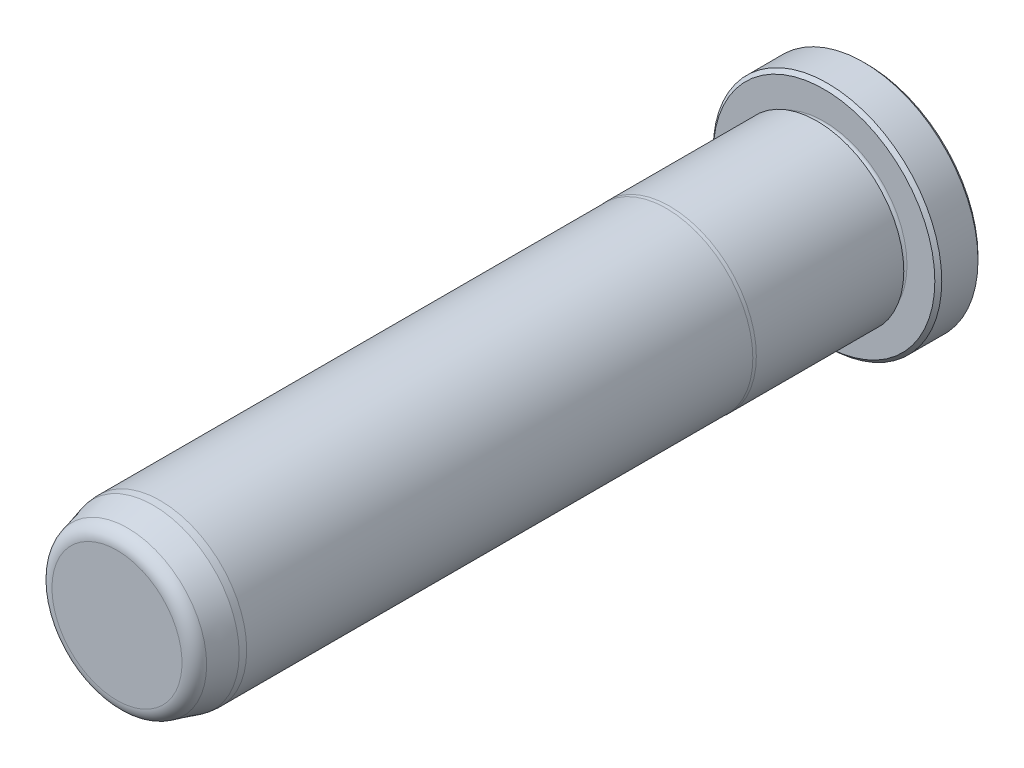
ISO-10303-21;
HEADER;
FILE_DESCRIPTION(('STEP AP214'),'2;1');
FILE_NAME('part.step','',(''),(''),'','','');
FILE_SCHEMA(('AUTOMOTIVE_DESIGN { 1 0 10303 214 1 1 1 1 }'));
ENDSEC;
DATA;
#1=APPLICATION_CONTEXT('core data for automotive mechanical design processes');
#2=APPLICATION_PROTOCOL_DEFINITION('international standard','automotive_design',2000,#1);
#3=PRODUCT_CONTEXT('',#1,'mechanical');
#4=PRODUCT('Part','Part','',(#3));
#5=PRODUCT_RELATED_PRODUCT_CATEGORY('part','',(#4));
#6=PRODUCT_DEFINITION_FORMATION('','',#4);
#7=PRODUCT_DEFINITION_CONTEXT('part definition',#1,'design');
#8=PRODUCT_DEFINITION('design','',#6,#7);
#9=PRODUCT_DEFINITION_SHAPE('','',#8);
#10=(LENGTH_UNIT() NAMED_UNIT(*) SI_UNIT(.MILLI.,.METRE.));
#11=(NAMED_UNIT(*) PLANE_ANGLE_UNIT() SI_UNIT($,.RADIAN.));
#12=(NAMED_UNIT(*) SI_UNIT($,.STERADIAN.) SOLID_ANGLE_UNIT());
#13=UNCERTAINTY_MEASURE_WITH_UNIT(LENGTH_MEASURE(1.E-05),#10,'distance_accuracy_value','');
#14=(GEOMETRIC_REPRESENTATION_CONTEXT(3) GLOBAL_UNCERTAINTY_ASSIGNED_CONTEXT((#13)) GLOBAL_UNIT_ASSIGNED_CONTEXT((#10,
#11,#12)) REPRESENTATION_CONTEXT('',''));
#15=CARTESIAN_POINT('',(0.,0.,0.));
#16=DIRECTION('',(0.,0.,1.));
#17=DIRECTION('',(1.,0.,0.));
#18=AXIS2_PLACEMENT_3D('',#15,#16,#17);
#19=CARTESIAN_POINT('',(0.,0.,0.));
#20=DIRECTION('',(0.,0.,1.));
#21=DIRECTION('',(1.,0.,0.));
#22=AXIS2_PLACEMENT_3D('',#19,#20,#21);
#23=PLANE('',#22);
#24=CARTESIAN_POINT('',(0.,0.,0.));
#25=DIRECTION('',(0.,0.,1.));
#26=DIRECTION('',(1.,0.,0.));
#27=AXIS2_PLACEMENT_3D('',#24,#25,#26);
#28=CIRCLE('',#27,12.192);
#29=CARTESIAN_POINT('',(12.192,0.,0.));
#30=VERTEX_POINT('',#29);
#31=EDGE_CURVE('E37',#30,#30,#28,.F.);
#32=ORIENTED_EDGE('',*,*,#31,.T.);
#33=EDGE_LOOP('',(#32));
#34=FACE_BOUND('',#33,.T.);
#35=ADVANCED_FACE('F30',(#34),#23,.F.);
#36=CARTESIAN_POINT('',(0.,0.,0.));
#37=DIRECTION('',(0.,0.,1.));
#38=DIRECTION('',(1.,0.,0.));
#39=AXIS2_PLACEMENT_3D('',#36,#37,#38);
#40=CYLINDRICAL_SURFACE('',#39,12.573);
#41=CARTESIAN_POINT('',(0.,0.,0.381000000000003));
#42=DIRECTION('',(0.,0.,1.));
#43=DIRECTION('',(1.,0.,0.));
#44=AXIS2_PLACEMENT_3D('',#41,#42,#43);
#45=CIRCLE('',#44,12.573);
#46=CARTESIAN_POINT('',(12.573,0.,0.381000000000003));
#47=VERTEX_POINT('',#46);
#48=EDGE_CURVE('E41',#47,#47,#45,.T.);
#49=ORIENTED_EDGE('',*,*,#48,.T.);
#50=EDGE_LOOP('',(#49));
#51=FACE_BOUND('',#50,.T.);
#52=CARTESIAN_POINT('',(0.,0.,4.36879999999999));
#53=DIRECTION('',(0.,0.,-1.));
#54=DIRECTION('',(-1.,0.,0.));
#55=AXIS2_PLACEMENT_3D('',#52,#53,#54);
#56=CIRCLE('',#55,12.573);
#57=CARTESIAN_POINT('',(-12.573,0.,4.36879999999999));
#58=VERTEX_POINT('',#57);
#59=EDGE_CURVE('E45',#58,#58,#56,.T.);
#60=ORIENTED_EDGE('',*,*,#59,.T.);
#61=EDGE_LOOP('',(#60));
#62=FACE_BOUND('',#61,.T.);
#63=ADVANCED_FACE('F118',(#51,#62),#40,.T.);
#64=CARTESIAN_POINT('',(0.,12.573,4.7498));
#65=DIRECTION('',(0.,0.,-1.));
#66=DIRECTION('',(-1.,0.,0.));
#67=AXIS2_PLACEMENT_3D('',#64,#65,#66);
#68=PLANE('',#67);
#69=CARTESIAN_POINT('',(0.,0.,4.7498));
#70=DIRECTION('',(0.,0.,-1.));
#71=DIRECTION('',(-1.,0.,0.));
#72=AXIS2_PLACEMENT_3D('',#69,#70,#71);
#73=CIRCLE('',#72,12.192);
#74=CARTESIAN_POINT('',(-12.192,0.,4.7498));
#75=VERTEX_POINT('',#74);
#76=EDGE_CURVE('E10',#75,#75,#73,.F.);
#77=ORIENTED_EDGE('',*,*,#76,.T.);
#78=EDGE_LOOP('',(#77));
#79=FACE_BOUND('',#78,.T.);
#80=CARTESIAN_POINT('',(0.,0.,4.7498));
#81=DIRECTION('',(0.,0.,1.));
#82=DIRECTION('',(1.,0.,0.));
#83=AXIS2_PLACEMENT_3D('',#80,#81,#82);
#84=CIRCLE('',#83,9.1313);
#85=CARTESIAN_POINT('',(9.1313,0.,4.7498));
#86=VERTEX_POINT('',#85);
#87=EDGE_CURVE('E56',#86,#86,#84,.T.);
#88=ORIENTED_EDGE('',*,*,#87,.F.);
#89=EDGE_LOOP('',(#88));
#90=FACE_BOUND('',#89,.T.);
#91=ADVANCED_FACE('F113',(#79,#90),#68,.F.);
#92=CARTESIAN_POINT('',(0.,0.,5.1308));
#93=DIRECTION('',(0.,0.,1.));
#94=DIRECTION('',(1.,0.,0.));
#95=AXIS2_PLACEMENT_3D('',#92,#93,#94);
#96=TOROIDAL_SURFACE('',#95,9.1313,0.381);
#97=CARTESIAN_POINT('',(0.,0.,5.5118));
#98=DIRECTION('',(0.,0.,1.));
#99=DIRECTION('',(1.,0.,0.));
#100=AXIS2_PLACEMENT_3D('',#97,#98,#99);
#101=CIRCLE('',#100,9.1313);
#102=CARTESIAN_POINT('',(9.1313,0.,5.5118));
#103=VERTEX_POINT('',#102);
#104=EDGE_CURVE('E59',#103,#103,#101,.T.);
#105=ORIENTED_EDGE('',*,*,#104,.F.);
#106=EDGE_LOOP('',(#105));
#107=FACE_BOUND('',#106,.T.);
#108=ORIENTED_EDGE('',*,*,#87,.T.);
#109=EDGE_LOOP('',(#108));
#110=FACE_BOUND('',#109,.T.);
#111=ADVANCED_FACE('F107',(#107,#110),#96,.F.);
#112=CARTESIAN_POINT('',(0.,9.1313,5.5118));
#113=DIRECTION('',(0.,0.,1.));
#114=DIRECTION('',(1.,0.,0.));
#115=AXIS2_PLACEMENT_3D('',#112,#113,#114);
#116=PLANE('',#115);
#117=CARTESIAN_POINT('',(0.,0.,5.5118));
#118=DIRECTION('',(0.,0.,1.));
#119=DIRECTION('',(1.,0.,0.));
#120=AXIS2_PLACEMENT_3D('',#117,#118,#119);
#121=CIRCLE('',#120,9.5377);
#122=CARTESIAN_POINT('',(9.5377,0.,5.5118));
#123=VERTEX_POINT('',#122);
#124=EDGE_CURVE('E62',#123,#123,#121,.T.);
#125=ORIENTED_EDGE('',*,*,#124,.F.);
#126=EDGE_LOOP('',(#125));
#127=FACE_BOUND('',#126,.T.);
#128=ORIENTED_EDGE('',*,*,#104,.T.);
#129=EDGE_LOOP('',(#128));
#130=FACE_BOUND('',#129,.T.);
#131=ADVANCED_FACE('F101',(#127,#130),#116,.F.);
#132=CARTESIAN_POINT('',(0.,0.,0.));
#133=DIRECTION('',(0.,0.,1.));
#134=DIRECTION('',(1.,0.,0.));
#135=AXIS2_PLACEMENT_3D('',#132,#133,#134);
#136=CYLINDRICAL_SURFACE('',#135,9.5377);
#137=CARTESIAN_POINT('',(0.,0.,21.7347630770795));
#138=DIRECTION('',(0.,0.,1.));
#139=DIRECTION('',(1.,0.,0.));
#140=AXIS2_PLACEMENT_3D('',#137,#138,#139);
#141=CIRCLE('',#140,9.5377);
#142=CARTESIAN_POINT('',(9.5377,0.,21.7347630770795));
#143=VERTEX_POINT('',#142);
#144=EDGE_CURVE('E65',#143,#143,#141,.T.);
#145=ORIENTED_EDGE('',*,*,#144,.F.);
#146=EDGE_LOOP('',(#145));
#147=FACE_BOUND('',#146,.T.);
#148=ORIENTED_EDGE('',*,*,#124,.T.);
#149=EDGE_LOOP('',(#148));
#150=FACE_BOUND('',#149,.T.);
#151=ADVANCED_FACE('F95',(#147,#150),#136,.T.);
#152=CARTESIAN_POINT('',(0.,0.,21.7347630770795));
#153=DIRECTION('',(0.,0.,-1.));
#154=DIRECTION('',(-1.,0.,0.));
#155=AXIS2_PLACEMENT_3D('',#152,#153,#154);
#156=CONICAL_SURFACE('',#155,9.5377,0.069813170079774);
#157=CARTESIAN_POINT('',(0.,0.,22.098));
#158=DIRECTION('',(0.,0.,1.));
#159=DIRECTION('',(1.,0.,0.));
#160=AXIS2_PLACEMENT_3D('',#157,#158,#159);
#161=CIRCLE('',#160,9.5123);
#162=CARTESIAN_POINT('',(9.5123,0.,22.098));
#163=VERTEX_POINT('',#162);
#164=EDGE_CURVE('E68',#163,#163,#161,.T.);
#165=ORIENTED_EDGE('',*,*,#164,.F.);
#166=EDGE_LOOP('',(#165));
#167=FACE_BOUND('',#166,.T.);
#168=ORIENTED_EDGE('',*,*,#144,.T.);
#169=EDGE_LOOP('',(#168));
#170=FACE_BOUND('',#169,.T.);
#171=ADVANCED_FACE('F89',(#167,#170),#156,.T.);
#172=CARTESIAN_POINT('',(0.,0.,0.));
#173=DIRECTION('',(0.,0.,1.));
#174=DIRECTION('',(1.,0.,0.));
#175=AXIS2_PLACEMENT_3D('',#172,#173,#174);
#176=CYLINDRICAL_SURFACE('',#175,9.5123);
#177=CARTESIAN_POINT('',(0.,0.,77.7875));
#178=DIRECTION('',(0.,0.,1.));
#179=DIRECTION('',(1.,0.,0.));
#180=AXIS2_PLACEMENT_3D('',#177,#178,#179);
#181=CIRCLE('',#180,9.51229999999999);
#182=CARTESIAN_POINT('',(9.51229999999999,0.,77.7875));
#183=VERTEX_POINT('',#182);
#184=EDGE_CURVE('E71',#183,#183,#181,.T.);
#185=ORIENTED_EDGE('',*,*,#184,.F.);
#186=EDGE_LOOP('',(#185));
#187=FACE_BOUND('',#186,.T.);
#188=ORIENTED_EDGE('',*,*,#164,.T.);
#189=EDGE_LOOP('',(#188));
#190=FACE_BOUND('',#189,.T.);
#191=ADVANCED_FACE('F83',(#187,#190),#176,.T.);
#192=CARTESIAN_POINT('',(0.,0.,77.7875));
#193=DIRECTION('',(0.,0.,-1.));
#194=DIRECTION('',(-1.,0.,0.));
#195=AXIS2_PLACEMENT_3D('',#192,#193,#194);
#196=CONICAL_SURFACE('',#195,9.51229999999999,0.0872664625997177);
#197=CARTESIAN_POINT('',(0.,0.,78.5495));
#198=DIRECTION('',(0.,0.,1.));
#199=DIRECTION('',(1.,0.,0.));
#200=AXIS2_PLACEMENT_3D('',#197,#198,#199);
#201=CIRCLE('',#200,9.44563363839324);
#202=CARTESIAN_POINT('',(9.44563363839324,0.,78.5495));
#203=VERTEX_POINT('',#202);
#204=EDGE_CURVE('E74',#203,#203,#201,.T.);
#205=ORIENTED_EDGE('',*,*,#204,.F.);
#206=EDGE_LOOP('',(#205));
#207=FACE_BOUND('',#206,.T.);
#208=ORIENTED_EDGE('',*,*,#184,.T.);
#209=EDGE_LOOP('',(#208));
#210=FACE_BOUND('',#209,.T.);
#211=ADVANCED_FACE('F80',(#207,#210),#196,.T.);
#212=CARTESIAN_POINT('',(0.,0.,78.5495));
#213=DIRECTION('',(0.,0.,-1.));
#214=DIRECTION('',(-1.,0.,0.));
#215=AXIS2_PLACEMENT_3D('',#212,#213,#214);
#216=CONICAL_SURFACE('',#215,9.44563363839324,0.26179938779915);
#217=CARTESIAN_POINT('',(0.,0.,81.3733752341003));
#218=DIRECTION('',(0.,0.,1.));
#219=DIRECTION('',(1.,0.,0.));
#220=AXIS2_PLACEMENT_3D('',#217,#218,#219);
#221=CIRCLE('',#220,8.68897854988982);
#222=CARTESIAN_POINT('',(8.68897854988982,0.,81.3733752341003));
#223=VERTEX_POINT('',#222);
#224=EDGE_CURVE('E50',#223,#223,#221,.F.);
#225=ORIENTED_EDGE('',*,*,#224,.T.);
#226=EDGE_LOOP('',(#225));
#227=FACE_BOUND('',#226,.T.);
#228=ORIENTED_EDGE('',*,*,#204,.T.);
#229=EDGE_LOOP('',(#228));
#230=FACE_BOUND('',#229,.T.);
#231=ADVANCED_FACE('F78',(#227,#230),#216,.T.);
#232=CARTESIAN_POINT('',(0.,8.37370289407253,82.55));
#233=DIRECTION('',(0.,0.,-1.));
#234=DIRECTION('',(-1.,0.,0.));
#235=AXIS2_PLACEMENT_3D('',#232,#233,#234);
#236=PLANE('',#235);
#237=CARTESIAN_POINT('',(0.,0.,82.55));
#238=DIRECTION('',(0.,0.,-1.));
#239=DIRECTION('',(-1.,0.,0.));
#240=AXIS2_PLACEMENT_3D('',#237,#238,#239);
#241=CIRCLE('',#240,7.15557130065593);
#242=CARTESIAN_POINT('',(-7.15557130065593,0.,82.55));
#243=VERTEX_POINT('',#242);
#244=EDGE_CURVE('E53',#243,#243,#241,.F.);
#245=ORIENTED_EDGE('',*,*,#244,.T.);
#246=EDGE_LOOP('',(#245));
#247=FACE_BOUND('',#246,.T.);
#248=ADVANCED_FACE('F133',(#247),#236,.F.);
#249=CARTESIAN_POINT('',(0.,0.,80.9625));
#250=DIRECTION('',(0.,0.,-1.));
#251=DIRECTION('',(-1.,0.,0.));
#252=AXIS2_PLACEMENT_3D('',#249,#250,#251);
#253=TOROIDAL_SURFACE('',#252,7.15557130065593,1.5875);
#254=ORIENTED_EDGE('',*,*,#224,.F.);
#255=EDGE_LOOP('',(#254));
#256=FACE_BOUND('',#255,.T.);
#257=ORIENTED_EDGE('',*,*,#244,.F.);
#258=EDGE_LOOP('',(#257));
#259=FACE_BOUND('',#258,.T.);
#260=ADVANCED_FACE('F130',(#256,#259),#253,.T.);
#261=CARTESIAN_POINT('',(0.,0.,0.381000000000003));
#262=DIRECTION('',(0.,0.,1.));
#263=DIRECTION('',(1.,0.,0.));
#264=AXIS2_PLACEMENT_3D('',#261,#262,#263);
#265=CONICAL_SURFACE('',#264,12.573,0.785398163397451);
#266=ORIENTED_EDGE('',*,*,#31,.F.);
#267=EDGE_LOOP('',(#266));
#268=FACE_BOUND('',#267,.T.);
#269=ORIENTED_EDGE('',*,*,#48,.F.);
#270=EDGE_LOOP('',(#269));
#271=FACE_BOUND('',#270,.T.);
#272=ADVANCED_FACE('F132',(#268,#271),#265,.T.);
#273=CARTESIAN_POINT('',(0.,0.,4.7498));
#274=DIRECTION('',(0.,0.,-1.));
#275=DIRECTION('',(-1.,0.,0.));
#276=AXIS2_PLACEMENT_3D('',#273,#274,#275);
#277=CONICAL_SURFACE('',#276,12.192,0.785398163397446);
#278=CARTESIAN_POINT('',(-12.573,0.,4.36879999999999));
#279=CARTESIAN_POINT('',(-12.56903125,0.,4.37276874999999));
#280=CARTESIAN_POINT('',(-12.5650625,0.,4.37673749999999));
#281=CARTESIAN_POINT('',(-12.557125,0.,4.38467499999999));
#282=CARTESIAN_POINT('',(-12.55315625,0.,4.38864374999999));
#283=CARTESIAN_POINT('',(-12.54521875,0.,4.39658124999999));
#284=CARTESIAN_POINT('',(-12.54125,0.,4.40054999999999));
#285=CARTESIAN_POINT('',(-12.5333125,0.,4.40848749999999));
#286=CARTESIAN_POINT('',(-12.52934375,0.,4.41245624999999));
#287=CARTESIAN_POINT('',(-12.52140625,0.,4.42039374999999));
#288=CARTESIAN_POINT('',(-12.5174375,0.,4.42436249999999));
#289=CARTESIAN_POINT('',(-12.5095,0.,4.43229999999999));
#290=CARTESIAN_POINT('',(-12.50553125,0.,4.43626874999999));
#291=CARTESIAN_POINT('',(-12.49759375,0.,4.44420624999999));
#292=CARTESIAN_POINT('',(-12.493625,0.,4.448175));
#293=CARTESIAN_POINT('',(-12.4856875,0.,4.4561125));
#294=CARTESIAN_POINT('',(-12.48171875,0.,4.46008124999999));
#295=CARTESIAN_POINT('',(-12.47378125,0.,4.46801874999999));
#296=CARTESIAN_POINT('',(-12.4698125,0.,4.47198749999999));
#297=CARTESIAN_POINT('',(-12.461875,0.,4.479925));
#298=CARTESIAN_POINT('',(-12.45790625,0.,4.48389375));
#299=CARTESIAN_POINT('',(-12.44996875,0.,4.49183125));
#300=CARTESIAN_POINT('',(-12.446,0.,4.49579999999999));
#301=CARTESIAN_POINT('',(-12.4380625,0.,4.5037375));
#302=CARTESIAN_POINT('',(-12.43409375,0.,4.50770625));
#303=CARTESIAN_POINT('',(-12.42615625,0.,4.51564375));
#304=CARTESIAN_POINT('',(-12.4221875,0.,4.5196125));
#305=CARTESIAN_POINT('',(-12.41425,0.,4.52755));
#306=CARTESIAN_POINT('',(-12.41028125,0.,4.53151875));
#307=CARTESIAN_POINT('',(-12.40234375,0.,4.53945625));
#308=CARTESIAN_POINT('',(-12.398375,0.,4.543425));
#309=CARTESIAN_POINT('',(-12.3904375,0.,4.5513625));
#310=CARTESIAN_POINT('',(-12.38646875,0.,4.55533125));
#311=CARTESIAN_POINT('',(-12.37853125,0.,4.56326875));
#312=CARTESIAN_POINT('',(-12.3745625,0.,4.5672375));
#313=CARTESIAN_POINT('',(-12.366625,0.,4.575175));
#314=CARTESIAN_POINT('',(-12.36265625,0.,4.57914375));
#315=CARTESIAN_POINT('',(-12.35471875,0.,4.58708125));
#316=CARTESIAN_POINT('',(-12.35075,0.,4.59105));
#317=CARTESIAN_POINT('',(-12.3428125,0.,4.5989875));
#318=CARTESIAN_POINT('',(-12.33884375,0.,4.60295625));
#319=CARTESIAN_POINT('',(-12.33090625,0.,4.61089375));
#320=CARTESIAN_POINT('',(-12.3269375,0.,4.6148625));
#321=CARTESIAN_POINT('',(-12.319,0.,4.6228));
#322=CARTESIAN_POINT('',(-12.31503125,0.,4.62676875));
#323=CARTESIAN_POINT('',(-12.30709375,0.,4.63470625));
#324=CARTESIAN_POINT('',(-12.303125,0.,4.638675));
#325=CARTESIAN_POINT('',(-12.2951875,0.,4.6466125));
#326=CARTESIAN_POINT('',(-12.29121875,0.,4.65058125));
#327=CARTESIAN_POINT('',(-12.28328125,0.,4.65851875));
#328=CARTESIAN_POINT('',(-12.2793125,0.,4.6624875));
#329=CARTESIAN_POINT('',(-12.271375,0.,4.670425));
#330=CARTESIAN_POINT('',(-12.26740625,0.,4.67439375));
#331=CARTESIAN_POINT('',(-12.25946875,0.,4.68233125));
#332=CARTESIAN_POINT('',(-12.2555,0.,4.6863));
#333=CARTESIAN_POINT('',(-12.2475625,0.,4.6942375));
#334=CARTESIAN_POINT('',(-12.24359375,0.,4.69820625));
#335=CARTESIAN_POINT('',(-12.23565625,0.,4.70614375));
#336=CARTESIAN_POINT('',(-12.2316875,0.,4.7101125));
#337=CARTESIAN_POINT('',(-12.22375,0.,4.71805));
#338=CARTESIAN_POINT('',(-12.21978125,0.,4.72201875));
#339=CARTESIAN_POINT('',(-12.21184375,0.,4.72995625));
#340=CARTESIAN_POINT('',(-12.207875,0.,4.733925));
#341=CARTESIAN_POINT('',(-12.1999375,0.,4.7418625));
#342=CARTESIAN_POINT('',(-12.19596875,0.,4.74583125));
#343=CARTESIAN_POINT('',(-12.192,0.,4.7498));
#344=B_SPLINE_CURVE_WITH_KNOTS('',3,(#278,#279,#280,#281,#282,#283,#284,#285,#286,#287,#288,
#289,#290,#291,#292,#293,#294,#295,#296,#297,#298,#299,#300,#301,#302,#303,#304,#305,#306,#307,
#308,#309,#310,#311,#312,#313,#314,#315,#316,#317,#318,#319,#320,#321,#322,#323,#324,#325,#326,
#327,#328,#329,#330,#331,#332,#333,#334,#335,#336,#337,#338,#339,#340,#341,#342,#343),
.UNSPECIFIED.,.F.,.F.,(4,2,2,2,2,2,2,2,2,2,2,2,2,2,2,2,2,2,2,2,2,2,2,2,2,2,2,2,2,2,2,2,4),(0.,
0.0168379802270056,0.0336759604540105,0.0505139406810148,0.0673519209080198,0.0841899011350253,
0.10102788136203,0.117865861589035,0.13470384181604,0.151541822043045,0.168379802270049,
0.185217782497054,0.202055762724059,0.218893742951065,0.235731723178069,0.252569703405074,
0.269407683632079,0.286245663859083,0.303083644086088,0.319921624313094,0.336759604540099,
0.353597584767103,0.370435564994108,0.387273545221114,0.404111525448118,0.420949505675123,
0.437787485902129,0.454625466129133,0.471463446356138,0.488301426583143,0.505139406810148,
0.521977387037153,0.538815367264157),.UNSPECIFIED.);
#345=EDGE_CURVE('BSEAM32',#58,#75,#344,.T.);
#346=ORIENTED_EDGE('',*,*,#59,.F.);
#347=ORIENTED_EDGE('',*,*,#76,.F.);
#348=ORIENTED_EDGE('',*,*,#345,.T.);
#349=ORIENTED_EDGE('',*,*,#345,.F.);
#350=EDGE_LOOP('',(#346,#348,#347,#349));
#351=FACE_BOUND('',#350,.T.);
#352=ADVANCED_FACE('F32',(#351),#277,.T.);
#353=CLOSED_SHELL('',(#35,#63,#91,#111,#131,#151,#171,#191,#211,#231,#248,#260,#272,#352));
#354=MANIFOLD_SOLID_BREP('B2',#353);
#355=ADVANCED_BREP_SHAPE_REPRESENTATION('',(#18,#354),#14);
#356=SHAPE_DEFINITION_REPRESENTATION(#9,#355);
ENDSEC;
END-ISO-10303-21;
